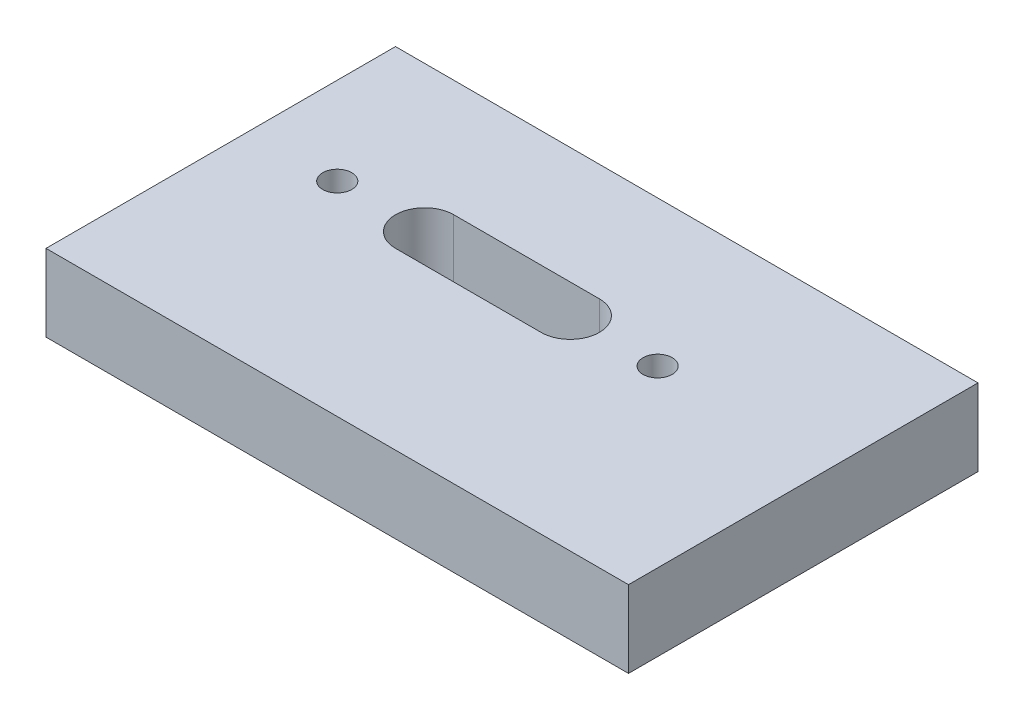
from build123d import *

# Parameters (mm, degrees)
SKETCH1_W           = 127
SKETCH1_H           = 76.2
BOSS_EXTRUDE1_DEPTH = 16.764
SKETCH2_R           = 3.175
CUT_EXTRUDE1_DEPTH  = 76.926883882


with BuildPart() as part:
    # Sketch1 → Boss-Extrude1 (new body)
    with BuildSketch(Plane(origin=(0, 0, 0), x_dir=(1, 0, 0), z_dir=(0, 1, 0))):
        Rectangle(SKETCH1_W, SKETCH1_H)
    extrude(amount=BOSS_EXTRUDE1_DEPTH)

    # Sketch2 → Cut-Extrude1 (cut, through all)
    with BuildSketch(Plane(origin=(0, 16.764, 0), x_dir=(1, 0, 0), z_dir=(0, 1, 0))):
        with Locations(Location((25.4, 6.35, 0), (0, 0, 270))):
            Circle(SKETCH2_R)
        with Locations(Location((-44.45, 6.35, 0), (0, 0, 90))):
            Circle(SKETCH2_R)
        with BuildLine():
            Line((-25.4, 12.7), (6.35, 12.7))
            ThreePointArc((6.35, 12.7), (12.7, 6.35), (6.35, 0))
            Line((6.35, 0), (-25.4, 0))
            ThreePointArc((-25.4, 0), (-31.75, 6.35), (-25.4, 12.7))
        make_face()
    extrude(amount=-CUT_EXTRUDE1_DEPTH, mode=Mode.SUBTRACT)


solid = part.part
